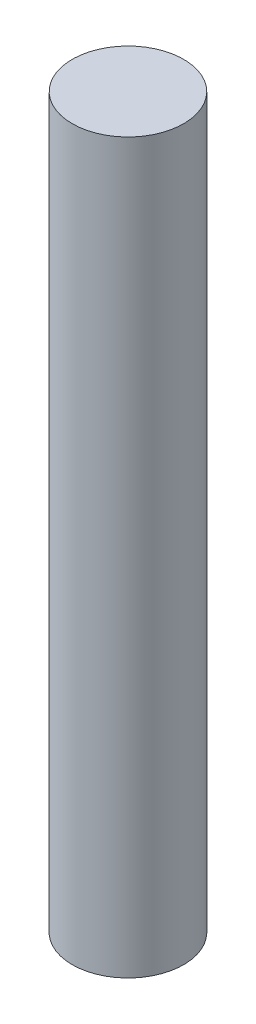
from build123d import *

# Parameters (mm, degrees)
SKETCH1_R           = 1.905
BOSS_EXTRUDE1_DEPTH = 24.892


with BuildPart() as part:
    # Sketch1 → Boss-Extrude1 (new body)
    with BuildSketch(Plane(origin=(0, 0, 0), x_dir=(1, 0, 0), z_dir=(0, 1, 0))):
        with Locations(Location((0, 0, 0), (0, 0, 270))):
            Circle(SKETCH1_R)
    extrude(amount=BOSS_EXTRUDE1_DEPTH)


solid = part.part
